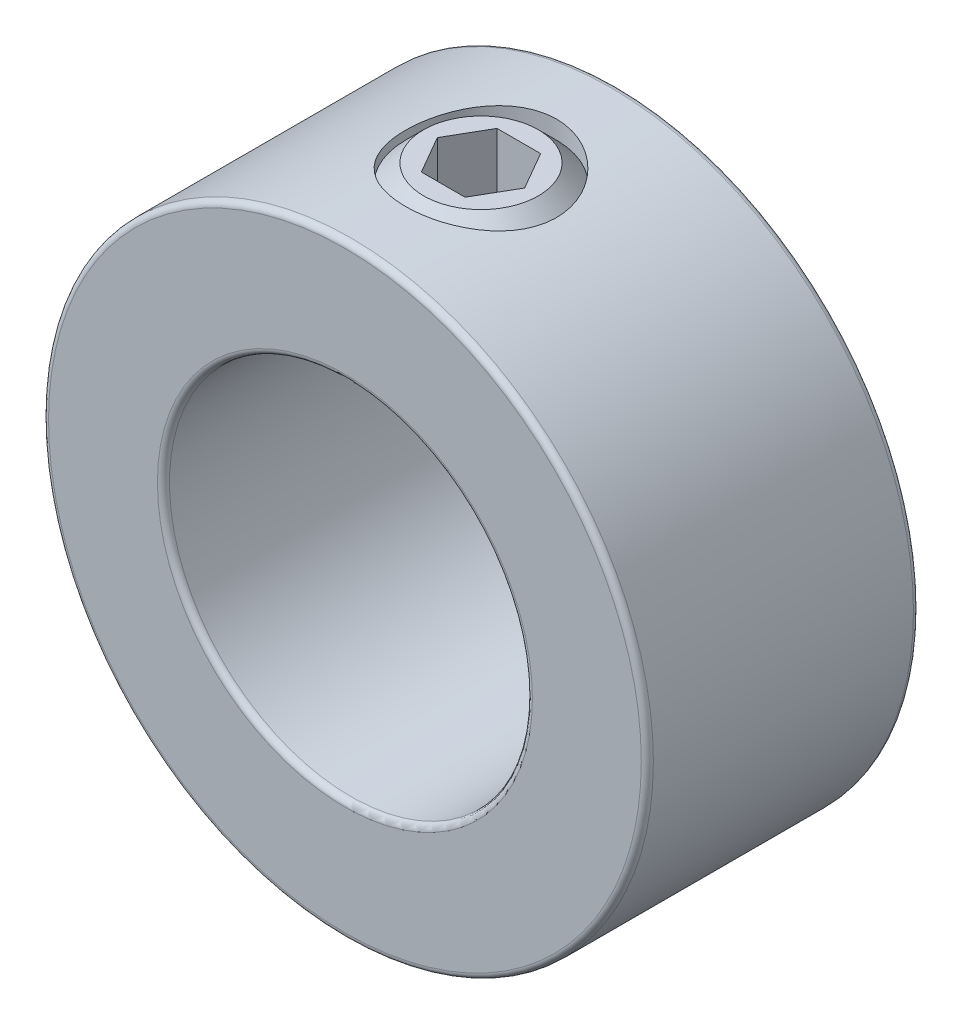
ISO-10303-21;
HEADER;
FILE_DESCRIPTION(('STEP AP214'),'2;1');
FILE_NAME('part.step','',(''),(''),'','','');
FILE_SCHEMA(('AUTOMOTIVE_DESIGN { 1 0 10303 214 1 1 1 1 }'));
ENDSEC;
DATA;
#1=APPLICATION_CONTEXT('core data for automotive mechanical design processes');
#2=APPLICATION_PROTOCOL_DEFINITION('international standard','automotive_design',2000,#1);
#3=PRODUCT_CONTEXT('',#1,'mechanical');
#4=PRODUCT('Part','Part','',(#3));
#5=PRODUCT_RELATED_PRODUCT_CATEGORY('part','',(#4));
#6=PRODUCT_DEFINITION_FORMATION('','',#4);
#7=PRODUCT_DEFINITION_CONTEXT('part definition',#1,'design');
#8=PRODUCT_DEFINITION('design','',#6,#7);
#9=PRODUCT_DEFINITION_SHAPE('','',#8);
#10=(LENGTH_UNIT() NAMED_UNIT(*) SI_UNIT(.MILLI.,.METRE.));
#11=(NAMED_UNIT(*) PLANE_ANGLE_UNIT() SI_UNIT($,.RADIAN.));
#12=(NAMED_UNIT(*) SI_UNIT($,.STERADIAN.) SOLID_ANGLE_UNIT());
#13=UNCERTAINTY_MEASURE_WITH_UNIT(LENGTH_MEASURE(1.E-05),#10,'distance_accuracy_value','');
#14=(GEOMETRIC_REPRESENTATION_CONTEXT(3) GLOBAL_UNCERTAINTY_ASSIGNED_CONTEXT((#13)) GLOBAL_UNIT_ASSIGNED_CONTEXT((#10,
#11,#12)) REPRESENTATION_CONTEXT('',''));
#15=CARTESIAN_POINT('',(0.,0.,0.));
#16=DIRECTION('',(0.,0.,1.));
#17=DIRECTION('',(1.,0.,0.));
#18=AXIS2_PLACEMENT_3D('',#15,#16,#17);
#19=CARTESIAN_POINT('',(0.,15.875,0.));
#20=DIRECTION('',(0.,1.,0.));
#21=DIRECTION('',(-1.,0.,0.));
#22=AXIS2_PLACEMENT_3D('',#19,#20,#21);
#23=PLANE('',#22);
#24=CARTESIAN_POINT('',(0.,15.875,0.));
#25=DIRECTION('',(0.,1.,0.));
#26=DIRECTION('',(-1.,0.,0.));
#27=AXIS2_PLACEMENT_3D('',#24,#25,#26);
#28=CIRCLE('',#27,3.01024078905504);
#29=CARTESIAN_POINT('',(-3.01024078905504,15.875,0.));
#30=VERTEX_POINT('',#29);
#31=EDGE_CURVE('E12',#30,#30,#28,.T.);
#32=ORIENTED_EDGE('',*,*,#31,.T.);
#33=EDGE_LOOP('',(#32));
#34=FACE_BOUND('',#33,.T.);
#35=DIRECTION('',(1.,0.,0.));
#36=VECTOR('',#35,1.);
#37=CARTESIAN_POINT('',(-1.14567944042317,15.875,-1.984375));
#38=LINE('',#37,#36);
#39=CARTESIAN_POINT('',(-1.14567944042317,15.875,-1.984375));
#40=VERTEX_POINT('',#39);
#41=CARTESIAN_POINT('',(1.14567944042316,15.875,-1.984375));
#42=VERTEX_POINT('',#41);
#43=EDGE_CURVE('E113',#40,#42,#38,.T.);
#44=ORIENTED_EDGE('',*,*,#43,.T.);
#45=DIRECTION('',(0.5,0.,0.866025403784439));
#46=VECTOR('',#45,1.);
#47=CARTESIAN_POINT('',(1.14567944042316,15.875,-1.984375));
#48=LINE('',#47,#46);
#49=CARTESIAN_POINT('',(2.29135888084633,15.875,0.));
#50=VERTEX_POINT('',#49);
#51=EDGE_CURVE('E59',#42,#50,#48,.T.);
#52=ORIENTED_EDGE('',*,*,#51,.T.);
#53=DIRECTION('',(-0.5,0.,0.866025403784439));
#54=VECTOR('',#53,1.);
#55=CARTESIAN_POINT('',(2.29135888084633,15.875,0.));
#56=LINE('',#55,#54);
#57=CARTESIAN_POINT('',(1.14567944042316,15.875,1.984375));
#58=VERTEX_POINT('',#57);
#59=EDGE_CURVE('E117',#50,#58,#56,.T.);
#60=ORIENTED_EDGE('',*,*,#59,.T.);
#61=DIRECTION('',(-1.,0.,0.));
#62=VECTOR('',#61,1.);
#63=CARTESIAN_POINT('',(1.14567944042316,15.875,1.984375));
#64=LINE('',#63,#62);
#65=CARTESIAN_POINT('',(-1.14567944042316,15.875,1.984375));
#66=VERTEX_POINT('',#65);
#67=EDGE_CURVE('E180',#58,#66,#64,.T.);
#68=ORIENTED_EDGE('',*,*,#67,.T.);
#69=DIRECTION('',(-0.5,0.,-0.866025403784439));
#70=VECTOR('',#69,1.);
#71=CARTESIAN_POINT('',(-1.14567944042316,15.875,1.984375));
#72=LINE('',#71,#70);
#73=CARTESIAN_POINT('',(-2.29135888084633,15.875,0.));
#74=VERTEX_POINT('',#73);
#75=EDGE_CURVE('E165',#66,#74,#72,.T.);
#76=ORIENTED_EDGE('',*,*,#75,.T.);
#77=DIRECTION('',(0.5,0.,-0.866025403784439));
#78=VECTOR('',#77,1.);
#79=CARTESIAN_POINT('',(-2.29135888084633,15.875,0.));
#80=LINE('',#79,#78);
#81=EDGE_CURVE('E161',#74,#40,#80,.T.);
#82=ORIENTED_EDGE('',*,*,#81,.T.);
#83=EDGE_LOOP('',(#44,#52,#60,#68,#76,#82));
#84=FACE_BOUND('',#83,.T.);
#85=ADVANCED_FACE('F45',(#34,#84),#23,.T.);
#86=CARTESIAN_POINT('',(0.,15.875,0.));
#87=DIRECTION('',(0.,-1.,0.));
#88=DIRECTION('',(1.,0.,0.));
#89=AXIS2_PLACEMENT_3D('',#86,#87,#88);
#90=CONICAL_SURFACE('',#89,3.01024078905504,0.785398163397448);
#91=CARTESIAN_POINT('',(0.,14.916490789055,0.));
#92=DIRECTION('',(0.,1.,0.));
#93=DIRECTION('',(-1.,0.,0.));
#94=AXIS2_PLACEMENT_3D('',#91,#92,#93);
#95=CIRCLE('',#94,3.96875);
#96=CARTESIAN_POINT('',(-3.96875,14.916490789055,0.));
#97=VERTEX_POINT('',#96);
#98=EDGE_CURVE('E52',#97,#97,#95,.T.);
#99=ORIENTED_EDGE('',*,*,#98,.T.);
#100=EDGE_LOOP('',(#99));
#101=FACE_BOUND('',#100,.T.);
#102=ORIENTED_EDGE('',*,*,#31,.F.);
#103=EDGE_LOOP('',(#102));
#104=FACE_BOUND('',#103,.T.);
#105=ADVANCED_FACE('F135',(#101,#104),#90,.T.);
#106=CARTESIAN_POINT('',(0.,9.525,0.));
#107=DIRECTION('',(0.,1.,0.));
#108=DIRECTION('',(-1.,0.,0.));
#109=AXIS2_PLACEMENT_3D('',#106,#107,#108);
#110=CYLINDRICAL_SURFACE('',#109,3.96875);
#111=CARTESIAN_POINT('',(0.,10.483509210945,0.));
#112=DIRECTION('',(0.,1.,0.));
#113=DIRECTION('',(-1.,0.,0.));
#114=AXIS2_PLACEMENT_3D('',#111,#112,#113);
#115=CIRCLE('',#114,3.96875);
#116=CARTESIAN_POINT('',(-3.96875,10.483509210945,0.));
#117=VERTEX_POINT('',#116);
#118=EDGE_CURVE('E130',#117,#117,#115,.T.);
#119=ORIENTED_EDGE('',*,*,#118,.T.);
#120=EDGE_LOOP('',(#119));
#121=FACE_BOUND('',#120,.T.);
#122=ORIENTED_EDGE('',*,*,#98,.F.);
#123=EDGE_LOOP('',(#122));
#124=FACE_BOUND('',#123,.T.);
#125=ADVANCED_FACE('F138',(#121,#124),#110,.T.);
#126=CARTESIAN_POINT('',(0.,10.483509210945,0.));
#127=DIRECTION('',(0.,1.,0.));
#128=DIRECTION('',(-1.,0.,0.));
#129=AXIS2_PLACEMENT_3D('',#126,#127,#128);
#130=CONICAL_SURFACE('',#129,3.96875,0.785398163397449);
#131=CARTESIAN_POINT('',(0.,9.525,0.));
#132=DIRECTION('',(0.,1.,0.));
#133=DIRECTION('',(-1.,0.,0.));
#134=AXIS2_PLACEMENT_3D('',#131,#132,#133);
#135=CIRCLE('',#134,3.01024078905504);
#136=CARTESIAN_POINT('',(-3.01024078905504,9.525,0.));
#137=VERTEX_POINT('',#136);
#138=EDGE_CURVE('E122',#137,#137,#135,.T.);
#139=ORIENTED_EDGE('',*,*,#138,.T.);
#140=EDGE_LOOP('',(#139));
#141=FACE_BOUND('',#140,.T.);
#142=ORIENTED_EDGE('',*,*,#118,.F.);
#143=EDGE_LOOP('',(#142));
#144=FACE_BOUND('',#143,.T.);
#145=ADVANCED_FACE('F140',(#141,#144),#130,.T.);
#146=CARTESIAN_POINT('',(-3.01024078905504,9.525,0.));
#147=DIRECTION('',(0.,-1.,0.));
#148=DIRECTION('',(1.,0.,0.));
#149=AXIS2_PLACEMENT_3D('',#146,#147,#148);
#150=PLANE('',#149);
#151=CARTESIAN_POINT('',(0.,9.525,0.));
#152=DIRECTION('',(0.,1.,0.));
#153=DIRECTION('',(-1.,0.,0.));
#154=AXIS2_PLACEMENT_3D('',#151,#152,#153);
#155=CIRCLE('',#154,1.15021105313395);
#156=CARTESIAN_POINT('',(-1.15021105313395,9.525,0.));
#157=VERTEX_POINT('',#156);
#158=EDGE_CURVE('E118',#157,#157,#155,.T.);
#159=ORIENTED_EDGE('',*,*,#158,.T.);
#160=EDGE_LOOP('',(#159));
#161=FACE_BOUND('',#160,.T.);
#162=ORIENTED_EDGE('',*,*,#138,.F.);
#163=EDGE_LOOP('',(#162));
#164=FACE_BOUND('',#163,.T.);
#165=ADVANCED_FACE('F147',(#161,#164),#150,.T.);
#166=CARTESIAN_POINT('',(0.,9.525,0.));
#167=DIRECTION('',(0.,-1.,0.));
#168=DIRECTION('',(1.,0.,0.));
#169=AXIS2_PLACEMENT_3D('',#166,#167,#168);
#170=CONICAL_SURFACE('',#169,1.15021105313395,0.785398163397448);
#171=CARTESIAN_POINT('',(0.,10.6752110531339,0.));
#172=VERTEX_POINT('',#171);
#173=VERTEX_LOOP('',#172);
#174=FACE_BOUND('',#173,.T.);
#175=ORIENTED_EDGE('',*,*,#158,.F.);
#176=EDGE_LOOP('',(#175));
#177=FACE_BOUND('',#176,.T.);
#178=ADVANCED_FACE('F214',(#174,#177),#170,.F.);
#179=CARTESIAN_POINT('',(1.14567944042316,11.90625,-1.984375));
#180=DIRECTION('',(-0.866025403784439,0.,0.5));
#181=DIRECTION('',(0.5,0.,0.866025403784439));
#182=AXIS2_PLACEMENT_3D('',#179,#180,#181);
#183=PLANE('',#182);
#184=ORIENTED_EDGE('',*,*,#51,.F.);
#185=DIRECTION('',(0.,1.,0.));
#186=VECTOR('',#185,1.);
#187=CARTESIAN_POINT('',(1.14567944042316,11.90625,-1.984375));
#188=LINE('',#187,#186);
#189=CARTESIAN_POINT('',(1.14567944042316,11.90625,-1.984375));
#190=VERTEX_POINT('',#189);
#191=EDGE_CURVE('E112',#190,#42,#188,.T.);
#192=ORIENTED_EDGE('',*,*,#191,.F.);
#193=DIRECTION('',(0.5,0.,0.866025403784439));
#194=VECTOR('',#193,1.);
#195=CARTESIAN_POINT('',(1.14567944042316,11.90625,-1.984375));
#196=LINE('',#195,#194);
#197=CARTESIAN_POINT('',(2.29135888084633,11.90625,0.));
#198=VERTEX_POINT('',#197);
#199=EDGE_CURVE('E103',#190,#198,#196,.T.);
#200=ORIENTED_EDGE('',*,*,#199,.T.);
#201=DIRECTION('',(0.,1.,0.));
#202=VECTOR('',#201,1.);
#203=CARTESIAN_POINT('',(2.29135888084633,11.90625,0.));
#204=LINE('',#203,#202);
#205=EDGE_CURVE('E111',#198,#50,#204,.T.);
#206=ORIENTED_EDGE('',*,*,#205,.T.);
#207=EDGE_LOOP('',(#184,#192,#200,#206));
#208=FACE_BOUND('',#207,.T.);
#209=ADVANCED_FACE('F110',(#208),#183,.T.);
#210=CARTESIAN_POINT('',(2.29135888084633,11.90625,0.));
#211=DIRECTION('',(-0.866025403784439,0.,-0.5));
#212=DIRECTION('',(-0.5,0.,0.866025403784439));
#213=AXIS2_PLACEMENT_3D('',#210,#211,#212);
#214=PLANE('',#213);
#215=ORIENTED_EDGE('',*,*,#59,.F.);
#216=ORIENTED_EDGE('',*,*,#205,.F.);
#217=DIRECTION('',(-0.5,0.,0.866025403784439));
#218=VECTOR('',#217,1.);
#219=CARTESIAN_POINT('',(2.29135888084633,11.90625,0.));
#220=LINE('',#219,#218);
#221=CARTESIAN_POINT('',(1.14567944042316,11.90625,1.984375));
#222=VERTEX_POINT('',#221);
#223=EDGE_CURVE('E99',#198,#222,#220,.T.);
#224=ORIENTED_EDGE('',*,*,#223,.T.);
#225=DIRECTION('',(0.,1.,0.));
#226=VECTOR('',#225,1.);
#227=CARTESIAN_POINT('',(1.14567944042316,11.90625,1.984375));
#228=LINE('',#227,#226);
#229=EDGE_CURVE('E119',#222,#58,#228,.T.);
#230=ORIENTED_EDGE('',*,*,#229,.T.);
#231=EDGE_LOOP('',(#215,#216,#224,#230));
#232=FACE_BOUND('',#231,.T.);
#233=ADVANCED_FACE('F115',(#232),#214,.T.);
#234=CARTESIAN_POINT('',(1.14567944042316,11.90625,1.984375));
#235=DIRECTION('',(0.,0.,-1.));
#236=DIRECTION('',(-1.,0.,0.));
#237=AXIS2_PLACEMENT_3D('',#234,#235,#236);
#238=PLANE('',#237);
#239=ORIENTED_EDGE('',*,*,#67,.F.);
#240=ORIENTED_EDGE('',*,*,#229,.F.);
#241=DIRECTION('',(-1.,0.,0.));
#242=VECTOR('',#241,1.);
#243=CARTESIAN_POINT('',(1.14567944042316,11.90625,1.984375));
#244=LINE('',#243,#242);
#245=CARTESIAN_POINT('',(-1.14567944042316,11.90625,1.984375));
#246=VERTEX_POINT('',#245);
#247=EDGE_CURVE('E105',#222,#246,#244,.T.);
#248=ORIENTED_EDGE('',*,*,#247,.T.);
#249=DIRECTION('',(0.,1.,0.));
#250=VECTOR('',#249,1.);
#251=CARTESIAN_POINT('',(-1.14567944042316,11.90625,1.984375));
#252=LINE('',#251,#250);
#253=EDGE_CURVE('E124',#246,#66,#252,.T.);
#254=ORIENTED_EDGE('',*,*,#253,.T.);
#255=EDGE_LOOP('',(#239,#240,#248,#254));
#256=FACE_BOUND('',#255,.T.);
#257=ADVANCED_FACE('F178',(#256),#238,.T.);
#258=CARTESIAN_POINT('',(-1.14567944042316,11.90625,1.984375));
#259=DIRECTION('',(0.866025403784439,0.,-0.5));
#260=DIRECTION('',(-0.5,0.,-0.866025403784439));
#261=AXIS2_PLACEMENT_3D('',#258,#259,#260);
#262=PLANE('',#261);
#263=ORIENTED_EDGE('',*,*,#75,.F.);
#264=ORIENTED_EDGE('',*,*,#253,.F.);
#265=DIRECTION('',(-0.5,0.,-0.866025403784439));
#266=VECTOR('',#265,1.);
#267=CARTESIAN_POINT('',(-1.14567944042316,11.90625,1.984375));
#268=LINE('',#267,#266);
#269=CARTESIAN_POINT('',(-2.29135888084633,11.90625,0.));
#270=VERTEX_POINT('',#269);
#271=EDGE_CURVE('E191',#246,#270,#268,.T.);
#272=ORIENTED_EDGE('',*,*,#271,.T.);
#273=DIRECTION('',(0.,1.,0.));
#274=VECTOR('',#273,1.);
#275=CARTESIAN_POINT('',(-2.29135888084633,11.90625,0.));
#276=LINE('',#275,#274);
#277=EDGE_CURVE('E173',#270,#74,#276,.T.);
#278=ORIENTED_EDGE('',*,*,#277,.T.);
#279=EDGE_LOOP('',(#263,#264,#272,#278));
#280=FACE_BOUND('',#279,.T.);
#281=ADVANCED_FACE('F182',(#280),#262,.T.);
#282=CARTESIAN_POINT('',(-2.29135888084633,11.90625,0.));
#283=DIRECTION('',(0.866025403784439,0.,0.5));
#284=DIRECTION('',(0.5,0.,-0.866025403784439));
#285=AXIS2_PLACEMENT_3D('',#282,#283,#284);
#286=PLANE('',#285);
#287=ORIENTED_EDGE('',*,*,#81,.F.);
#288=ORIENTED_EDGE('',*,*,#277,.F.);
#289=DIRECTION('',(0.5,0.,-0.866025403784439));
#290=VECTOR('',#289,1.);
#291=CARTESIAN_POINT('',(-2.29135888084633,11.90625,0.));
#292=LINE('',#291,#290);
#293=CARTESIAN_POINT('',(-1.14567944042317,11.90625,-1.984375));
#294=VERTEX_POINT('',#293);
#295=EDGE_CURVE('E189',#270,#294,#292,.T.);
#296=ORIENTED_EDGE('',*,*,#295,.T.);
#297=DIRECTION('',(0.,1.,0.));
#298=VECTOR('',#297,1.);
#299=CARTESIAN_POINT('',(-1.14567944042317,11.90625,-1.984375));
#300=LINE('',#299,#298);
#301=EDGE_CURVE('E170',#294,#40,#300,.T.);
#302=ORIENTED_EDGE('',*,*,#301,.T.);
#303=EDGE_LOOP('',(#287,#288,#296,#302));
#304=FACE_BOUND('',#303,.T.);
#305=ADVANCED_FACE('F195',(#304),#286,.T.);
#306=CARTESIAN_POINT('',(-1.14567944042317,11.90625,-1.984375));
#307=DIRECTION('',(0.,0.,1.));
#308=DIRECTION('',(1.,0.,0.));
#309=AXIS2_PLACEMENT_3D('',#306,#307,#308);
#310=PLANE('',#309);
#311=ORIENTED_EDGE('',*,*,#43,.F.);
#312=ORIENTED_EDGE('',*,*,#301,.F.);
#313=DIRECTION('',(1.,0.,0.));
#314=VECTOR('',#313,1.);
#315=CARTESIAN_POINT('',(-1.14567944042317,11.90625,-1.984375));
#316=LINE('',#315,#314);
#317=EDGE_CURVE('E171',#294,#190,#316,.T.);
#318=ORIENTED_EDGE('',*,*,#317,.T.);
#319=ORIENTED_EDGE('',*,*,#191,.T.);
#320=EDGE_LOOP('',(#311,#312,#318,#319));
#321=FACE_BOUND('',#320,.T.);
#322=ADVANCED_FACE('F196',(#321),#310,.T.);
#323=CARTESIAN_POINT('',(3.43703832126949,11.90625,1.984375));
#324=DIRECTION('',(0.,-1.,0.));
#325=DIRECTION('',(0.,0.,-1.));
#326=AXIS2_PLACEMENT_3D('',#323,#324,#325);
#327=PLANE('',#326);
#328=ORIENTED_EDGE('',*,*,#199,.F.);
#329=ORIENTED_EDGE('',*,*,#317,.F.);
#330=ORIENTED_EDGE('',*,*,#295,.F.);
#331=ORIENTED_EDGE('',*,*,#271,.F.);
#332=ORIENTED_EDGE('',*,*,#247,.F.);
#333=ORIENTED_EDGE('',*,*,#223,.F.);
#334=EDGE_LOOP('',(#328,#329,#330,#331,#332,#333));
#335=FACE_BOUND('',#334,.T.);
#336=ADVANCED_FACE('F101',(#335),#327,.F.);
#337=CLOSED_SHELL('',(#85,#105,#125,#145,#165,#178,#209,#233,#257,#281,#305,#322,#336));
#338=MANIFOLD_SOLID_BREP('B2',#337);
#339=CARTESIAN_POINT('',(0.,0.,7.14375));
#340=DIRECTION('',(0.,0.,1.));
#341=DIRECTION('',(1.,0.,0.));
#342=AXIS2_PLACEMENT_3D('',#339,#340,#341);
#343=PLANE('',#342);
#344=CARTESIAN_POINT('',(0.,0.,7.14375));
#345=DIRECTION('',(0.,0.,1.));
#346=DIRECTION('',(1.,0.,0.));
#347=AXIS2_PLACEMENT_3D('',#344,#345,#346);
#348=CIRCLE('',#347,9.8425);
#349=CARTESIAN_POINT('',(9.8425,0.,7.14375));
#350=VERTEX_POINT('',#349);
#351=EDGE_CURVE('E311',#350,#350,#348,.F.);
#352=ORIENTED_EDGE('',*,*,#351,.T.);
#353=EDGE_LOOP('',(#352));
#354=FACE_BOUND('',#353,.T.);
#355=CARTESIAN_POINT('',(0.,0.,7.14375));
#356=DIRECTION('',(0.,0.,1.));
#357=DIRECTION('',(1.,0.,0.));
#358=AXIS2_PLACEMENT_3D('',#355,#356,#357);
#359=CIRCLE('',#358,15.5575);
#360=CARTESIAN_POINT('',(15.5575,0.,7.14375));
#361=VERTEX_POINT('',#360);
#362=EDGE_CURVE('E315',#361,#361,#359,.T.);
#363=ORIENTED_EDGE('',*,*,#362,.T.);
#364=EDGE_LOOP('',(#363));
#365=FACE_BOUND('',#364,.T.);
#366=ADVANCED_FACE('F300',(#354,#365),#343,.T.);
#367=CARTESIAN_POINT('',(0.,0.,-7.14375));
#368=DIRECTION('',(0.,0.,1.));
#369=DIRECTION('',(1.,0.,0.));
#370=AXIS2_PLACEMENT_3D('',#367,#368,#369);
#371=PLANE('',#370);
#372=CARTESIAN_POINT('',(0.,0.,-7.14375));
#373=DIRECTION('',(0.,0.,1.));
#374=DIRECTION('',(1.,0.,0.));
#375=AXIS2_PLACEMENT_3D('',#372,#373,#374);
#376=CIRCLE('',#375,9.8425);
#377=CARTESIAN_POINT('',(9.8425,0.,-7.14375));
#378=VERTEX_POINT('',#377);
#379=EDGE_CURVE('E326',#378,#378,#376,.T.);
#380=ORIENTED_EDGE('',*,*,#379,.T.);
#381=EDGE_LOOP('',(#380));
#382=FACE_BOUND('',#381,.T.);
#383=CARTESIAN_POINT('',(0.,0.,-7.14375));
#384=DIRECTION('',(0.,0.,1.));
#385=DIRECTION('',(1.,0.,0.));
#386=AXIS2_PLACEMENT_3D('',#383,#384,#385);
#387=CIRCLE('',#386,15.5575);
#388=CARTESIAN_POINT('',(15.5575,0.,-7.14375));
#389=VERTEX_POINT('',#388);
#390=EDGE_CURVE('E329',#389,#389,#387,.F.);
#391=ORIENTED_EDGE('',*,*,#390,.T.);
#392=EDGE_LOOP('',(#391));
#393=FACE_BOUND('',#392,.T.);
#394=ADVANCED_FACE('F363',(#382,#393),#371,.F.);
#395=CARTESIAN_POINT('',(0.,0.,7.14375));
#396=DIRECTION('',(0.,0.,-1.));
#397=DIRECTION('',(-1.,0.,0.));
#398=AXIS2_PLACEMENT_3D('',#395,#396,#397);
#399=CYLINDRICAL_SURFACE('',#398,15.875);
#400=CARTESIAN_POINT('',(0.,0.,-6.82625));
#401=DIRECTION('',(0.,0.,1.));
#402=DIRECTION('',(1.,0.,0.));
#403=AXIS2_PLACEMENT_3D('',#400,#401,#402);
#404=CIRCLE('',#403,15.875);
#405=CARTESIAN_POINT('',(15.875,0.,-6.82625));
#406=VERTEX_POINT('',#405);
#407=EDGE_CURVE('E44',#406,#406,#404,.T.);
#408=ORIENTED_EDGE('',*,*,#407,.T.);
#409=EDGE_LOOP('',(#408));
#410=FACE_BOUND('',#409,.T.);
#411=CARTESIAN_POINT('',(0.,0.,6.82625));
#412=DIRECTION('',(0.,0.,1.));
#413=DIRECTION('',(1.,0.,0.));
#414=AXIS2_PLACEMENT_3D('',#411,#412,#413);
#415=CIRCLE('',#414,15.875);
#416=CARTESIAN_POINT('',(15.875,0.,6.82625));
#417=VERTEX_POINT('',#416);
#418=EDGE_CURVE('E307',#417,#417,#415,.F.);
#419=ORIENTED_EDGE('',*,*,#418,.T.);
#420=EDGE_LOOP('',(#419));
#421=FACE_BOUND('',#420,.T.);
#422=CARTESIAN_POINT('',(0.,15.875,-3.96875));
#423=CARTESIAN_POINT('',(0.219276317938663,15.8749962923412,-3.96874384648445));
#424=CARTESIAN_POINT('',(0.438621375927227,15.8704115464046,-3.95051610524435));
#425=CARTESIAN_POINT('',(0.871025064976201,15.8525663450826,-3.87819595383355));
#426=CARTESIAN_POINT('',(1.08408006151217,15.8393009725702,-3.8240832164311));
#427=CARTESIAN_POINT('',(1.49759689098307,15.8055634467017,-3.68183780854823));
#428=CARTESIAN_POINT('',(1.69807351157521,15.7850999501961,-3.59374599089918));
#429=CARTESIAN_POINT('',(2.08140334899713,15.73914555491,-3.38618673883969));
#430=CARTESIAN_POINT('',(2.26425597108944,15.7136544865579,-3.2667182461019));
#431=CARTESIAN_POINT('',(2.61091343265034,15.6598253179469,-2.99719791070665));
#432=CARTESIAN_POINT('',(2.77430359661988,15.6314432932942,-2.84662145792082));
#433=CARTESIAN_POINT('',(3.07379403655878,15.5753228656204,-2.52028270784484));
#434=CARTESIAN_POINT('',(3.20989123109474,15.5475845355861,-2.34451757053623));
#435=CARTESIAN_POINT('',(3.45288272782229,15.4954492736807,-1.96957096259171));
#436=CARTESIAN_POINT('',(3.55931315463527,15.4711081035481,-1.7700804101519));
#437=CARTESIAN_POINT('',(3.73696682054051,15.42916371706,-1.35533232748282));
#438=CARTESIAN_POINT('',(3.80819568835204,15.4115594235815,-1.14007732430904));
#439=CARTESIAN_POINT('',(3.91200967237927,15.3855334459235,-0.704470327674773));
#440=CARTESIAN_POINT('',(3.94534037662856,15.3769348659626,-0.484306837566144));
#441=CARTESIAN_POINT('',(3.97473427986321,15.3693643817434,-0.0413581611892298));
#442=CARTESIAN_POINT('',(3.97080354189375,15.3703909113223,0.181426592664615));
#443=CARTESIAN_POINT('',(3.92638101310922,15.3817956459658,0.617579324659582));
#444=CARTESIAN_POINT('',(3.88677769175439,15.3919465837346,0.831044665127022));
#445=CARTESIAN_POINT('',(3.77355149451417,15.4200941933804,1.24820111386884));
#446=CARTESIAN_POINT('',(3.6999261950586,15.4380914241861,1.45189152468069));
#447=CARTESIAN_POINT('',(3.51998882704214,15.4801123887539,1.84609850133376));
#448=CARTESIAN_POINT('',(3.41335430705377,15.5041951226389,2.03646132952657));
#449=CARTESIAN_POINT('',(3.17065098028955,15.5556402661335,2.39690991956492));
#450=CARTESIAN_POINT('',(3.03457702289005,15.5830032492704,2.5669921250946));
#451=CARTESIAN_POINT('',(2.73225531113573,15.638882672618,2.88714289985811));
#452=CARTESIAN_POINT('',(2.56525780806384,15.6674097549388,3.03650250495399));
#453=CARTESIAN_POINT('',(2.20824403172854,15.7216995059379,3.30523120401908));
#454=CARTESIAN_POINT('',(2.01822705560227,15.7474620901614,3.42459938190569));
#455=CARTESIAN_POINT('',(1.61955662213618,15.7934483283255,3.63021717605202));
#456=CARTESIAN_POINT('',(1.41084139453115,15.8136526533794,3.71635162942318));
#457=CARTESIAN_POINT('',(0.981276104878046,15.8461053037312,3.85211453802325));
#458=CARTESIAN_POINT('',(0.760428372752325,15.8583551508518,3.90174997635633));
#459=CARTESIAN_POINT('',(0.318928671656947,15.8732934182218,3.96202314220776));
#460=CARTESIAN_POINT('',(0.0984163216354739,15.8762184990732,3.97362633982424));
#461=CARTESIAN_POINT('',(-0.341399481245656,15.8728517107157,3.96015368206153));
#462=CARTESIAN_POINT('',(-0.560703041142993,15.8665606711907,3.93508112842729));
#463=CARTESIAN_POINT('',(-0.988521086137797,15.8456201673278,3.84976447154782));
#464=CARTESIAN_POINT('',(-1.19714729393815,15.8310959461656,3.79004707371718));
#465=CARTESIAN_POINT('',(-1.60140991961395,15.7953261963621,3.63773750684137));
#466=CARTESIAN_POINT('',(-1.79704502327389,15.7740799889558,3.54514201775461));
#467=CARTESIAN_POINT('',(-2.17361329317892,15.7266562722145,3.32783357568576));
#468=CARTESIAN_POINT('',(-2.35422398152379,15.7003979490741,3.20257986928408));
#469=CARTESIAN_POINT('',(-2.69220583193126,15.6459901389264,2.92420169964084));
#470=CARTESIAN_POINT('',(-2.8495729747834,15.6178403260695,2.77107242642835));
#471=CARTESIAN_POINT('',(-3.14057921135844,15.5619703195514,2.43680731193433));
#472=CARTESIAN_POINT('',(-3.27354106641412,15.5342776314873,2.25507628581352));
#473=CARTESIAN_POINT('',(-3.50708054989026,15.4832282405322,1.87131157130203));
#474=CARTESIAN_POINT('',(-3.60765961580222,15.4598713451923,1.66927878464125));
#475=CARTESIAN_POINT('',(-3.77282980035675,15.4203954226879,1.25172860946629));
#476=CARTESIAN_POINT('',(-3.83763413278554,15.4042336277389,1.03629981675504));
#477=CARTESIAN_POINT('',(-3.92997705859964,15.3809367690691,0.597139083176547));
#478=CARTESIAN_POINT('',(-3.95752380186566,15.3737997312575,0.37340896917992));
#479=CARTESIAN_POINT('',(-3.97414377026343,15.3695109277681,-0.0691118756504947));
#480=CARTESIAN_POINT('',(-3.96429943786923,15.3720782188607,-0.287859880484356));
#481=CARTESIAN_POINT('',(-3.90889404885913,15.3862592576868,-0.720470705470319));
#482=CARTESIAN_POINT('',(-3.86333371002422,15.3978728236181,-0.934333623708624));
#483=CARTESIAN_POINT('',(-3.73838078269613,15.428681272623,-1.3499265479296));
#484=CARTESIAN_POINT('',(-3.65919121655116,15.447830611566,-1.55172120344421));
#485=CARTESIAN_POINT('',(-3.46938841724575,15.4915593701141,-1.93930424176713));
#486=CARTESIAN_POINT('',(-3.35877082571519,15.5161395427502,-2.12509039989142));
#487=CARTESIAN_POINT('',(-3.10585841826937,15.5687615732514,-2.48061328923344));
#488=CARTESIAN_POINT('',(-2.96281253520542,15.5968770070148,-2.64980492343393));
#489=CARTESIAN_POINT('',(-2.65056771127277,15.6529623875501,-2.9621348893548));
#490=CARTESIAN_POINT('',(-2.48136256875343,15.680932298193,-3.1052670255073));
#491=CARTESIAN_POINT('',(-2.11790382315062,15.7341796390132,-3.36394242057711));
#492=CARTESIAN_POINT('',(-1.92325207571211,15.7593991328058,-3.47893908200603));
#493=CARTESIAN_POINT('',(-1.51676644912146,15.8036928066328,-3.67439432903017));
#494=CARTESIAN_POINT('',(-1.30494501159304,15.8227713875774,-3.75487766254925));
#495=CARTESIAN_POINT('',(-0.911252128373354,15.8498132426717,-3.8670754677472));
#496=CARTESIAN_POINT('',(-0.731255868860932,15.8591933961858,-3.90512099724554));
#497=CARTESIAN_POINT('',(-0.367522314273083,15.8717880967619,-3.95595989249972));
#498=CARTESIAN_POINT('',(-0.183785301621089,15.8750031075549,-3.96875515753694));
#499=CARTESIAN_POINT('',(0.,15.875,-3.96875));
#500=B_SPLINE_CURVE_WITH_KNOTS('',3,(#422,#423,#424,#425,#426,#427,#428,#429,#430,#431,#432,
#433,#434,#435,#436,#437,#438,#439,#440,#441,#442,#443,#444,#445,#446,#447,#448,#449,#450,#451,
#452,#453,#454,#455,#456,#457,#458,#459,#460,#461,#462,#463,#464,#465,#466,#467,#468,#469,#470,
#471,#472,#473,#474,#475,#476,#477,#478,#479,#480,#481,#482,#483,#484,#485,#486,#487,#488,#489,
#490,#491,#492,#493,#494,#495,#496,#497,#498,#499),.UNSPECIFIED.,.T.,.F.,(4,2,2,2,2,2,2,2,2,2,2,
2,2,2,2,2,2,2,2,2,2,2,2,2,2,2,2,2,2,2,2,2,2,2,2,2,2,2,4),(0.,0.657155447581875,1.31468346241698,
1.97142338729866,2.62818546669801,3.29709027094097,3.96607055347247,4.64498921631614,
5.32379928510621,5.98901030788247,6.65411309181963,7.30309523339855,7.95212361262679,
8.60770355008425,9.26339827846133,9.9377897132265,10.6122017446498,11.288930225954,
11.9655291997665,12.6248135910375,13.2840386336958,13.9334947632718,14.5830164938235,
15.2440636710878,15.9052250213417,16.5826151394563,17.2599751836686,17.93325340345,
18.6063843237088,19.2601791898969,19.9139609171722,20.5638505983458,21.2138304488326,
21.8807658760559,22.5478596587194,23.2270349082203,23.9057223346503,24.4565551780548,
25.0073465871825),.UNSPECIFIED.);
#501=CARTESIAN_POINT('',(0.,15.875,-3.96875));
#502=VERTEX_POINT('',#501);
#503=EDGE_CURVE('E332',#502,#502,#500,.T.);
#504=ORIENTED_EDGE('',*,*,#503,.T.);
#505=EDGE_LOOP('',(#504));
#506=FACE_BOUND('',#505,.T.);
#507=ADVANCED_FACE('F359',(#410,#421,#506),#399,.T.);
#508=CARTESIAN_POINT('',(0.,0.,7.14375));
#509=DIRECTION('',(0.,0.,-1.));
#510=DIRECTION('',(-1.,0.,0.));
#511=AXIS2_PLACEMENT_3D('',#508,#509,#510);
#512=CYLINDRICAL_SURFACE('',#511,9.525);
#513=CARTESIAN_POINT('',(0.,0.,-6.82625));
#514=DIRECTION('',(0.,0.,1.));
#515=DIRECTION('',(1.,0.,0.));
#516=AXIS2_PLACEMENT_3D('',#513,#514,#515);
#517=CIRCLE('',#516,9.525);
#518=CARTESIAN_POINT('',(9.525,0.,-6.82625));
#519=VERTEX_POINT('',#518);
#520=EDGE_CURVE('E320',#519,#519,#517,.F.);
#521=ORIENTED_EDGE('',*,*,#520,.T.);
#522=EDGE_LOOP('',(#521));
#523=FACE_BOUND('',#522,.T.);
#524=CARTESIAN_POINT('',(0.,0.,6.82625));
#525=DIRECTION('',(0.,0.,1.));
#526=DIRECTION('',(1.,0.,0.));
#527=AXIS2_PLACEMENT_3D('',#524,#525,#526);
#528=CIRCLE('',#527,9.525);
#529=CARTESIAN_POINT('',(9.525,0.,6.82625));
#530=VERTEX_POINT('',#529);
#531=EDGE_CURVE('E323',#530,#530,#528,.T.);
#532=ORIENTED_EDGE('',*,*,#531,.T.);
#533=EDGE_LOOP('',(#532));
#534=FACE_BOUND('',#533,.T.);
#535=CARTESIAN_POINT('',(0.,9.525,-3.96875));
#536=CARTESIAN_POINT('',(0.106339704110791,9.52499940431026,-3.96874924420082));
#537=CARTESIAN_POINT('',(0.212715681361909,9.52321418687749,-3.96447001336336));
#538=CARTESIAN_POINT('',(0.424708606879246,9.51611852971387,-3.94739427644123));
#539=CARTESIAN_POINT('',(0.530325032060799,9.51080585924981,-3.93459238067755));
#540=CARTESIAN_POINT('',(0.740196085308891,9.49677884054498,-3.90056443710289));
#541=CARTESIAN_POINT('',(0.844447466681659,9.48805752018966,-3.8793211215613));
#542=CARTESIAN_POINT('',(1.05063078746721,9.46744770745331,-3.82863481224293));
#543=CARTESIAN_POINT('',(1.15256176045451,9.45555792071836,-3.79918846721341));
#544=CARTESIAN_POINT('',(1.45304856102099,9.41566954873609,-3.69918624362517));
#545=CARTESIAN_POINT('',(1.64725042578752,9.38338421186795,-3.61681028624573));
#546=CARTESIAN_POINT('',(2.01878960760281,9.31053593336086,-3.4233641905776));
#547=CARTESIAN_POINT('',(2.1961320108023,9.2699754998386,-3.31230274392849));
#548=CARTESIAN_POINT('',(2.53824093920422,9.18234884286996,-3.05870239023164));
#549=CARTESIAN_POINT('',(2.70205730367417,9.13506952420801,-2.91495316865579));
#550=CARTESIAN_POINT('',(3.00405615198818,9.04026456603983,-2.60267091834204));
#551=CARTESIAN_POINT('',(3.14222513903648,8.99273881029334,-2.43412492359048));
#552=CARTESIAN_POINT('',(3.39579467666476,8.9001883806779,-2.06679786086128));
#553=CARTESIAN_POINT('',(3.50974047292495,8.85540182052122,-1.86693718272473));
#554=CARTESIAN_POINT('',(3.65386256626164,8.79645372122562,-1.55355911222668));
#555=CARTESIAN_POINT('',(3.69744892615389,8.7781707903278,-1.44679096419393));
#556=CARTESIAN_POINT('',(3.77528941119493,8.74497623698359,-1.22941680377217));
#557=CARTESIAN_POINT('',(3.80954833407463,8.73006288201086,-1.11881279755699));
#558=CARTESIAN_POINT('',(3.86694170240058,8.70478736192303,-0.899958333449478));
#559=CARTESIAN_POINT('',(3.89052895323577,8.69424199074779,-0.791847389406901));
#560=CARTESIAN_POINT('',(3.92861373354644,8.6770995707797,-0.573771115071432));
#561=CARTESIAN_POINT('',(3.94311546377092,8.67050069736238,-0.463806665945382));
#562=CARTESIAN_POINT('',(3.9628609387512,8.66149391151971,-0.242906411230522));
#563=CARTESIAN_POINT('',(3.96810707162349,8.65908491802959,-0.131970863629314));
#564=CARTESIAN_POINT('',(3.96928172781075,8.65854653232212,0.0899554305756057));
#565=CARTESIAN_POINT('',(3.96521074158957,8.6604169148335,0.200946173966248));
#566=CARTESIAN_POINT('',(3.94847322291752,8.66805984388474,0.413533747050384));
#567=CARTESIAN_POINT('',(3.9364922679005,8.67352102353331,0.515196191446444));
#568=CARTESIAN_POINT('',(3.90477208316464,8.68784624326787,0.717069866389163));
#569=CARTESIAN_POINT('',(3.88503031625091,8.696711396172,0.817280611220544));
#570=CARTESIAN_POINT('',(3.81443477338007,8.72802607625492,1.11466693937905));
#571=CARTESIAN_POINT('',(3.75219655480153,8.75520186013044,1.30877252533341));
#572=CARTESIAN_POINT('',(3.59796791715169,8.8197115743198,1.68772720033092));
#573=CARTESIAN_POINT('',(3.50537257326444,8.85724935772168,1.87229142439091));
#574=CARTESIAN_POINT('',(3.29346810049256,8.93820695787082,2.22400833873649));
#575=CARTESIAN_POINT('',(3.17414843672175,8.98162909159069,2.39115412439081));
#576=CARTESIAN_POINT('',(2.90034934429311,9.07392703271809,2.71811992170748));
#577=CARTESIAN_POINT('',(2.74375071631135,9.12295360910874,2.87612703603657));
#578=CARTESIAN_POINT('',(2.40579154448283,9.21784011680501,3.16424718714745));
#579=CARTESIAN_POINT('',(2.22442521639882,9.26369930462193,3.29435368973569));
#580=CARTESIAN_POINT('',(1.83657221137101,9.34841550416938,3.52563392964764));
#581=CARTESIAN_POINT('',(1.62960234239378,9.38708646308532,3.62607053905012));
#582=CARTESIAN_POINT('',(1.1996813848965,9.4516410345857,3.79006456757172));
#583=CARTESIAN_POINT('',(0.976739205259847,9.47753171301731,3.85364236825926));
#584=CARTESIAN_POINT('',(0.536346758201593,9.51228860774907,3.93832078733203));
#585=CARTESIAN_POINT('',(0.319440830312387,9.52212792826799,3.96185345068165));
#586=CARTESIAN_POINT('',(-0.115426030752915,9.52677959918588,3.97302425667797));
#587=CARTESIAN_POINT('',(-0.333386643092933,9.52159626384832,3.96067270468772));
#588=CARTESIAN_POINT('',(-0.752786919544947,9.4974161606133,3.90216680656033));
#589=CARTESIAN_POINT('',(-0.954509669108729,9.47911767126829,3.85772039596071));
#590=CARTESIAN_POINT('',(-1.34741522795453,9.43129326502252,3.73866348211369));
#591=CARTESIAN_POINT('',(-1.53859670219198,9.40176592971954,3.6640491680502));
#592=CARTESIAN_POINT('',(-1.91169607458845,9.33317509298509,3.48433715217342));
#593=CARTESIAN_POINT('',(-2.09314172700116,9.29384385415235,3.37836451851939));
#594=CARTESIAN_POINT('',(-2.43632423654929,9.20984329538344,3.13990552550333));
#595=CARTESIAN_POINT('',(-2.59805281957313,9.16517174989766,3.0074080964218));
#596=CARTESIAN_POINT('',(-2.90935864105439,9.07135879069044,2.70858223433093));
#597=CARTESIAN_POINT('',(-3.05724146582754,9.02212608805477,2.54051275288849));
#598=CARTESIAN_POINT('',(-3.32317676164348,8.92760269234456,2.1811574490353));
#599=CARTESIAN_POINT('',(-3.44122245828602,8.88231289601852,1.98986636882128));
#600=CARTESIAN_POINT('',(-3.64540673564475,8.80050901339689,1.58554999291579));
#601=CARTESIAN_POINT('',(-3.73106690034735,8.76412911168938,1.37225393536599));
#602=CARTESIAN_POINT('',(-3.86452789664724,8.70611529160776,0.932273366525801));
#603=CARTESIAN_POINT('',(-3.91235994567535,8.68446921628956,0.705600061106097));
#604=CARTESIAN_POINT('',(-3.96570453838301,8.66023047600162,0.264100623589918));
#605=CARTESIAN_POINT('',(-3.97419128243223,8.65629940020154,0.0497056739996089));
#606=CARTESIAN_POINT('',(-3.95654456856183,8.66437982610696,-0.377326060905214));
#607=CARTESIAN_POINT('',(-3.93041642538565,8.67638888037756,-0.589963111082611));
#608=CARTESIAN_POINT('',(-3.84677918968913,8.71377327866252,-0.99724455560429));
#609=CARTESIAN_POINT('',(-3.79078759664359,8.73850035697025,-1.19226573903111));
#610=CARTESIAN_POINT('',(-3.65049901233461,8.79802591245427,-1.57018966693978));
#611=CARTESIAN_POINT('',(-3.56619406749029,8.83282721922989,-1.7530889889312));
#612=CARTESIAN_POINT('',(-3.36582424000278,8.91117616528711,-2.11358565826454));
#613=CARTESIAN_POINT('',(-3.2481544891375,8.95512388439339,-2.2902029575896));
#614=CARTESIAN_POINT('',(-2.98668090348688,9.04569075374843,-2.62210138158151));
#615=CARTESIAN_POINT('',(-2.84286800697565,9.09231082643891,-2.77737507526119));
#616=CARTESIAN_POINT('',(-2.52060299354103,9.18707098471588,-3.07389036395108));
#617=CARTESIAN_POINT('',(-2.34039087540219,9.23507447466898,-3.21328628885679));
#618=CARTESIAN_POINT('',(-2.05338852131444,9.30155622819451,-3.39817492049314));
#619=CARTESIAN_POINT('',(-1.95485248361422,9.32281142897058,-3.45580765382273));
#620=CARTESIAN_POINT('',(-1.7528076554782,9.36289852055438,-3.56253706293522));
#621=CARTESIAN_POINT('',(-1.64930118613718,9.38173152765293,-3.61163767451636));
#622=CARTESIAN_POINT('',(-1.43970220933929,9.41615560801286,-3.70013143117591));
#623=CARTESIAN_POINT('',(-1.33367770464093,9.43179378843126,-3.73966750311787));
#624=CARTESIAN_POINT('',(-1.11828343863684,9.4597489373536,-3.80962337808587));
#625=CARTESIAN_POINT('',(-1.0089152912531,9.47206748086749,-3.84004750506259));
#626=CARTESIAN_POINT('',(-0.787917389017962,9.49300284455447,-3.89140117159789));
#627=CARTESIAN_POINT('',(-0.676293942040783,9.50162880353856,-3.91235415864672));
#628=CARTESIAN_POINT('',(-0.451486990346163,9.51495896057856,-3.944618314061));
#629=CARTESIAN_POINT('',(-0.338304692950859,9.51966603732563,-3.9559365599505));
#630=CARTESIAN_POINT('',(-0.187413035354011,9.52322990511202,-3.96450008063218));
#631=CARTESIAN_POINT('',(-0.14995271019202,9.52389333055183,-3.96609336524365));
#632=CARTESIAN_POINT('',(-0.0749964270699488,9.52477848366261,-3.96821845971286));
#633=CARTESIAN_POINT('',(-0.0375004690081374,9.52500021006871,-3.96875026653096));
#634=CARTESIAN_POINT('',(0.,9.525,-3.96875));
#635=B_SPLINE_CURVE_WITH_KNOTS('',3,(#535,#536,#537,#538,#539,#540,#541,#542,#543,#544,#545,
#546,#547,#548,#549,#550,#551,#552,#553,#554,#555,#556,#557,#558,#559,#560,#561,#562,#563,#564,
#565,#566,#567,#568,#569,#570,#571,#572,#573,#574,#575,#576,#577,#578,#579,#580,#581,#582,#583,
#584,#585,#586,#587,#588,#589,#590,#591,#592,#593,#594,#595,#596,#597,#598,#599,#600,#601,#602,
#603,#604,#605,#606,#607,#608,#609,#610,#611,#612,#613,#614,#615,#616,#617,#618,#619,#620,#621,
#622,#623,#624,#625,#626,#627,#628,#629,#630,#631,#632,#633,#634),.UNSPECIFIED.,.T.,.F.,(4,2,2,
2,2,2,2,2,2,2,2,2,2,2,2,2,2,2,2,2,2,2,2,2,2,2,2,2,2,2,2,2,2,2,2,2,2,2,2,2,2,2,2,2,2,2,2,2,2,4),
(0.,0.318980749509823,0.638163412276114,0.958002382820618,1.27797221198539,1.91504647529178,
2.55192793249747,3.2180268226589,3.8844752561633,4.58371459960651,4.93360722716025,
5.28331953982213,5.61634537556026,5.94921712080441,6.28200296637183,6.61477129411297,
6.92193148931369,7.22919218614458,7.84319027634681,8.47025383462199,9.09756502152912,
9.77789117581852,10.458376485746,11.1545684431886,11.8503750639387,12.5021777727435,
13.153793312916,13.773071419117,14.3924277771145,15.0310237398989,15.6698867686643,
16.3544066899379,17.0390818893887,17.7335092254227,18.4273628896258,19.0678058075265,
19.7081504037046,20.318685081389,20.9293914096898,21.5768183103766,22.2244700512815,
22.919292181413,23.2672758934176,23.6150986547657,23.9573486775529,24.2994360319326,
24.6406717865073,24.9816566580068,25.0941442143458,25.206632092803),.UNSPECIFIED.);
#636=CARTESIAN_POINT('',(0.,9.525,-3.96875));
#637=VERTEX_POINT('',#636);
#638=EDGE_CURVE('E333',#637,#637,#635,.T.);
#639=ORIENTED_EDGE('',*,*,#638,.F.);
#640=EDGE_LOOP('',(#639));
#641=FACE_BOUND('',#640,.T.);
#642=ADVANCED_FACE('F343',(#523,#534,#641),#512,.F.);
#643=CARTESIAN_POINT('',(0.,15.875,0.));
#644=DIRECTION('',(0.,-1.,0.));
#645=DIRECTION('',(0.,0.,-1.));
#646=AXIS2_PLACEMENT_3D('',#643,#644,#645);
#647=CYLINDRICAL_SURFACE('',#646,3.96875);
#648=ORIENTED_EDGE('',*,*,#638,.T.);
#649=EDGE_LOOP('',(#648));
#650=FACE_BOUND('',#649,.T.);
#651=ORIENTED_EDGE('',*,*,#503,.F.);
#652=EDGE_LOOP('',(#651));
#653=FACE_BOUND('',#652,.T.);
#654=ADVANCED_FACE('F346',(#650,#653),#647,.F.);
#655=CARTESIAN_POINT('',(0.,0.,-6.82625));
#656=DIRECTION('',(0.,0.,1.));
#657=DIRECTION('',(1.,0.,0.));
#658=AXIS2_PLACEMENT_3D('',#655,#656,#657);
#659=TOROIDAL_SURFACE('',#658,9.8425,0.3175);
#660=ORIENTED_EDGE('',*,*,#520,.F.);
#661=EDGE_LOOP('',(#660));
#662=FACE_BOUND('',#661,.T.);
#663=ORIENTED_EDGE('',*,*,#379,.F.);
#664=EDGE_LOOP('',(#663));
#665=FACE_BOUND('',#664,.T.);
#666=ADVANCED_FACE('F349',(#662,#665),#659,.T.);
#667=CARTESIAN_POINT('',(0.,0.,6.82625));
#668=DIRECTION('',(0.,0.,1.));
#669=DIRECTION('',(1.,0.,0.));
#670=AXIS2_PLACEMENT_3D('',#667,#668,#669);
#671=TOROIDAL_SURFACE('',#670,9.8425,0.3175);
#672=ORIENTED_EDGE('',*,*,#351,.F.);
#673=EDGE_LOOP('',(#672));
#674=FACE_BOUND('',#673,.T.);
#675=ORIENTED_EDGE('',*,*,#531,.F.);
#676=EDGE_LOOP('',(#675));
#677=FACE_BOUND('',#676,.T.);
#678=ADVANCED_FACE('F356',(#674,#677),#671,.T.);
#679=CARTESIAN_POINT('',(0.,0.,-6.82625));
#680=DIRECTION('',(0.,0.,1.));
#681=DIRECTION('',(1.,0.,0.));
#682=AXIS2_PLACEMENT_3D('',#679,#680,#681);
#683=TOROIDAL_SURFACE('',#682,15.5575,0.3175);
#684=ORIENTED_EDGE('',*,*,#390,.F.);
#685=EDGE_LOOP('',(#684));
#686=FACE_BOUND('',#685,.T.);
#687=ORIENTED_EDGE('',*,*,#407,.F.);
#688=EDGE_LOOP('',(#687));
#689=FACE_BOUND('',#688,.T.);
#690=ADVANCED_FACE('F375',(#686,#689),#683,.T.);
#691=CARTESIAN_POINT('',(0.,0.,6.82625));
#692=DIRECTION('',(0.,0.,1.));
#693=DIRECTION('',(1.,0.,0.));
#694=AXIS2_PLACEMENT_3D('',#691,#692,#693);
#695=TOROIDAL_SURFACE('',#694,15.5575,0.3175);
#696=ORIENTED_EDGE('',*,*,#418,.F.);
#697=EDGE_LOOP('',(#696));
#698=FACE_BOUND('',#697,.T.);
#699=ORIENTED_EDGE('',*,*,#362,.F.);
#700=EDGE_LOOP('',(#699));
#701=FACE_BOUND('',#700,.T.);
#702=ADVANCED_FACE('F302',(#698,#701),#695,.T.);
#703=CLOSED_SHELL('',(#366,#394,#507,#642,#654,#666,#678,#690,#702));
#704=MANIFOLD_SOLID_BREP('B6',#703);
#705=ADVANCED_BREP_SHAPE_REPRESENTATION('',(#18,#338,#704),#14);
#706=SHAPE_DEFINITION_REPRESENTATION(#9,#705);
ENDSEC;
END-ISO-10303-21;
